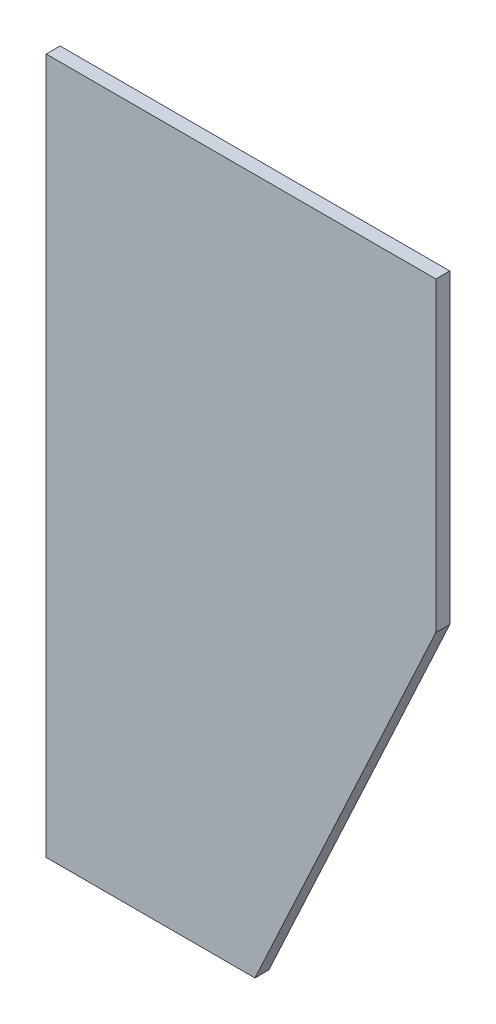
ISO-10303-21;
HEADER;
FILE_DESCRIPTION(('STEP AP214'),'2;1');
FILE_NAME('part.step','',(''),(''),'','','');
FILE_SCHEMA(('AUTOMOTIVE_DESIGN { 1 0 10303 214 1 1 1 1 }'));
ENDSEC;
DATA;
#1=APPLICATION_CONTEXT('core data for automotive mechanical design processes');
#2=APPLICATION_PROTOCOL_DEFINITION('international standard','automotive_design',2000,#1);
#3=PRODUCT_CONTEXT('',#1,'mechanical');
#4=PRODUCT('Part','Part','',(#3));
#5=PRODUCT_RELATED_PRODUCT_CATEGORY('part','',(#4));
#6=PRODUCT_DEFINITION_FORMATION('','',#4);
#7=PRODUCT_DEFINITION_CONTEXT('part definition',#1,'design');
#8=PRODUCT_DEFINITION('design','',#6,#7);
#9=PRODUCT_DEFINITION_SHAPE('','',#8);
#10=(LENGTH_UNIT() NAMED_UNIT(*) SI_UNIT(.MILLI.,.METRE.));
#11=(NAMED_UNIT(*) PLANE_ANGLE_UNIT() SI_UNIT($,.RADIAN.));
#12=(NAMED_UNIT(*) SI_UNIT($,.STERADIAN.) SOLID_ANGLE_UNIT());
#13=UNCERTAINTY_MEASURE_WITH_UNIT(LENGTH_MEASURE(1.E-05),#10,'distance_accuracy_value','');
#14=(GEOMETRIC_REPRESENTATION_CONTEXT(3) GLOBAL_UNCERTAINTY_ASSIGNED_CONTEXT((#13)) GLOBAL_UNIT_ASSIGNED_CONTEXT((#10,
#11,#12)) REPRESENTATION_CONTEXT('',''));
#15=CARTESIAN_POINT('',(0.,0.,0.));
#16=DIRECTION('',(0.,0.,1.));
#17=DIRECTION('',(1.,0.,0.));
#18=AXIS2_PLACEMENT_3D('',#15,#16,#17);
#19=CARTESIAN_POINT('',(150.,0.,10.));
#20=DIRECTION('',(0.,1.,0.));
#21=DIRECTION('',(-1.,0.,0.));
#22=AXIS2_PLACEMENT_3D('',#19,#20,#21);
#23=PLANE('',#22);
#24=DIRECTION('',(1.,0.,0.));
#25=VECTOR('',#24,1.);
#26=CARTESIAN_POINT('',(150.,0.,0.));
#27=LINE('',#26,#25);
#28=CARTESIAN_POINT('',(0.,0.,0.));
#29=VERTEX_POINT('',#28);
#30=CARTESIAN_POINT('',(150.,0.,0.));
#31=VERTEX_POINT('',#30);
#32=EDGE_CURVE('E105',#29,#31,#27,.T.);
#33=ORIENTED_EDGE('',*,*,#32,.T.);
#34=DIRECTION('',(0.,0.,-1.));
#35=VECTOR('',#34,1.);
#36=CARTESIAN_POINT('',(150.,0.,10.));
#37=LINE('',#36,#35);
#38=CARTESIAN_POINT('',(150.,0.,10.));
#39=VERTEX_POINT('',#38);
#40=EDGE_CURVE('E11',#39,#31,#37,.T.);
#41=ORIENTED_EDGE('',*,*,#40,.F.);
#42=DIRECTION('',(1.,0.,0.));
#43=VECTOR('',#42,1.);
#44=CARTESIAN_POINT('',(150.,0.,10.));
#45=LINE('',#44,#43);
#46=CARTESIAN_POINT('',(0.,0.,10.));
#47=VERTEX_POINT('',#46);
#48=EDGE_CURVE('E113',#47,#39,#45,.T.);
#49=ORIENTED_EDGE('',*,*,#48,.F.);
#50=DIRECTION('',(0.,0.,-1.));
#51=VECTOR('',#50,1.);
#52=CARTESIAN_POINT('',(0.,0.,10.));
#53=LINE('',#52,#51);
#54=EDGE_CURVE('E101',#47,#29,#53,.T.);
#55=ORIENTED_EDGE('',*,*,#54,.T.);
#56=EDGE_LOOP('',(#33,#41,#49,#55));
#57=FACE_BOUND('',#56,.T.);
#58=ADVANCED_FACE('F31',(#57),#23,.F.);
#59=CARTESIAN_POINT('',(280.,280.,10.));
#60=DIRECTION('',(-0.907008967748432,0.421111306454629,0.));
#61=DIRECTION('',(-0.421111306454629,-0.907008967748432,0.));
#62=AXIS2_PLACEMENT_3D('',#59,#60,#61);
#63=PLANE('',#62);
#64=DIRECTION('',(0.421111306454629,0.907008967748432,0.));
#65=VECTOR('',#64,1.);
#66=CARTESIAN_POINT('',(280.,280.,0.));
#67=LINE('',#66,#65);
#68=CARTESIAN_POINT('',(280.,280.,0.));
#69=VERTEX_POINT('',#68);
#70=EDGE_CURVE('E108',#31,#69,#67,.T.);
#71=ORIENTED_EDGE('',*,*,#70,.T.);
#72=DIRECTION('',(0.,0.,-1.));
#73=VECTOR('',#72,1.);
#74=CARTESIAN_POINT('',(280.,280.,10.));
#75=LINE('',#74,#73);
#76=CARTESIAN_POINT('',(280.,280.,10.));
#77=VERTEX_POINT('',#76);
#78=EDGE_CURVE('E39',#77,#69,#75,.T.);
#79=ORIENTED_EDGE('',*,*,#78,.F.);
#80=DIRECTION('',(0.421111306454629,0.907008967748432,0.));
#81=VECTOR('',#80,1.);
#82=CARTESIAN_POINT('',(280.,280.,10.));
#83=LINE('',#82,#81);
#84=EDGE_CURVE('E81',#39,#77,#83,.T.);
#85=ORIENTED_EDGE('',*,*,#84,.F.);
#86=ORIENTED_EDGE('',*,*,#40,.T.);
#87=EDGE_LOOP('',(#71,#79,#85,#86));
#88=FACE_BOUND('',#87,.T.);
#89=ADVANCED_FACE('F132',(#88),#63,.F.);
#90=CARTESIAN_POINT('',(280.,500.,10.));
#91=DIRECTION('',(-1.,0.,0.));
#92=DIRECTION('',(0.,0.,1.));
#93=AXIS2_PLACEMENT_3D('',#90,#91,#92);
#94=PLANE('',#93);
#95=DIRECTION('',(0.,1.,0.));
#96=VECTOR('',#95,1.);
#97=CARTESIAN_POINT('',(280.,500.,0.));
#98=LINE('',#97,#96);
#99=CARTESIAN_POINT('',(280.,500.,0.));
#100=VERTEX_POINT('',#99);
#101=EDGE_CURVE('E96',#69,#100,#98,.T.);
#102=ORIENTED_EDGE('',*,*,#101,.T.);
#103=DIRECTION('',(0.,0.,-1.));
#104=VECTOR('',#103,1.);
#105=CARTESIAN_POINT('',(280.,500.,10.));
#106=LINE('',#105,#104);
#107=CARTESIAN_POINT('',(280.,500.,10.));
#108=VERTEX_POINT('',#107);
#109=EDGE_CURVE('E93',#108,#100,#106,.T.);
#110=ORIENTED_EDGE('',*,*,#109,.F.);
#111=DIRECTION('',(0.,1.,0.));
#112=VECTOR('',#111,1.);
#113=CARTESIAN_POINT('',(280.,500.,10.));
#114=LINE('',#113,#112);
#115=EDGE_CURVE('E85',#77,#108,#114,.T.);
#116=ORIENTED_EDGE('',*,*,#115,.F.);
#117=ORIENTED_EDGE('',*,*,#78,.T.);
#118=EDGE_LOOP('',(#102,#110,#116,#117));
#119=FACE_BOUND('',#118,.T.);
#120=ADVANCED_FACE('F94',(#119),#94,.F.);
#121=CARTESIAN_POINT('',(0.,500.,10.));
#122=DIRECTION('',(0.,-1.,0.));
#123=DIRECTION('',(0.,0.,-1.));
#124=AXIS2_PLACEMENT_3D('',#121,#122,#123);
#125=PLANE('',#124);
#126=DIRECTION('',(-1.,0.,0.));
#127=VECTOR('',#126,1.);
#128=CARTESIAN_POINT('',(0.,500.,0.));
#129=LINE('',#128,#127);
#130=CARTESIAN_POINT('',(0.,500.,0.));
#131=VERTEX_POINT('',#130);
#132=EDGE_CURVE('E67',#100,#131,#129,.T.);
#133=ORIENTED_EDGE('',*,*,#132,.T.);
#134=DIRECTION('',(0.,0.,-1.));
#135=VECTOR('',#134,1.);
#136=CARTESIAN_POINT('',(0.,500.,10.));
#137=LINE('',#136,#135);
#138=CARTESIAN_POINT('',(0.,500.,10.));
#139=VERTEX_POINT('',#138);
#140=EDGE_CURVE('E97',#139,#131,#137,.T.);
#141=ORIENTED_EDGE('',*,*,#140,.F.);
#142=DIRECTION('',(-1.,0.,0.));
#143=VECTOR('',#142,1.);
#144=CARTESIAN_POINT('',(0.,500.,10.));
#145=LINE('',#144,#143);
#146=EDGE_CURVE('E89',#108,#139,#145,.T.);
#147=ORIENTED_EDGE('',*,*,#146,.F.);
#148=ORIENTED_EDGE('',*,*,#109,.T.);
#149=EDGE_LOOP('',(#133,#141,#147,#148));
#150=FACE_BOUND('',#149,.T.);
#151=ADVANCED_FACE('F99',(#150),#125,.F.);
#152=CARTESIAN_POINT('',(0.,0.,10.));
#153=DIRECTION('',(1.,0.,0.));
#154=DIRECTION('',(0.,0.,-1.));
#155=AXIS2_PLACEMENT_3D('',#152,#153,#154);
#156=PLANE('',#155);
#157=DIRECTION('',(0.,-1.,0.));
#158=VECTOR('',#157,1.);
#159=CARTESIAN_POINT('',(0.,0.,0.));
#160=LINE('',#159,#158);
#161=EDGE_CURVE('E73',#131,#29,#160,.T.);
#162=ORIENTED_EDGE('',*,*,#161,.T.);
#163=ORIENTED_EDGE('',*,*,#54,.F.);
#164=DIRECTION('',(0.,-1.,0.));
#165=VECTOR('',#164,1.);
#166=CARTESIAN_POINT('',(0.,0.,10.));
#167=LINE('',#166,#165);
#168=EDGE_CURVE('E47',#139,#47,#167,.T.);
#169=ORIENTED_EDGE('',*,*,#168,.F.);
#170=ORIENTED_EDGE('',*,*,#140,.T.);
#171=EDGE_LOOP('',(#162,#163,#169,#170));
#172=FACE_BOUND('',#171,.T.);
#173=ADVANCED_FACE('F121',(#172),#156,.F.);
#174=CARTESIAN_POINT('',(0.,0.,10.));
#175=DIRECTION('',(0.,0.,-1.));
#176=DIRECTION('',(-1.,0.,0.));
#177=AXIS2_PLACEMENT_3D('',#174,#175,#176);
#178=PLANE('',#177);
#179=ORIENTED_EDGE('',*,*,#48,.T.);
#180=ORIENTED_EDGE('',*,*,#84,.T.);
#181=ORIENTED_EDGE('',*,*,#115,.T.);
#182=ORIENTED_EDGE('',*,*,#146,.T.);
#183=ORIENTED_EDGE('',*,*,#168,.T.);
#184=EDGE_LOOP('',(#179,#180,#181,#182,#183));
#185=FACE_BOUND('',#184,.T.);
#186=ADVANCED_FACE('F87',(#185),#178,.F.);
#187=CARTESIAN_POINT('',(0.,0.,0.));
#188=DIRECTION('',(0.,0.,-1.));
#189=DIRECTION('',(-1.,0.,0.));
#190=AXIS2_PLACEMENT_3D('',#187,#188,#189);
#191=PLANE('',#190);
#192=ORIENTED_EDGE('',*,*,#32,.F.);
#193=ORIENTED_EDGE('',*,*,#161,.F.);
#194=ORIENTED_EDGE('',*,*,#132,.F.);
#195=ORIENTED_EDGE('',*,*,#101,.F.);
#196=ORIENTED_EDGE('',*,*,#70,.F.);
#197=EDGE_LOOP('',(#192,#193,#194,#195,#196));
#198=FACE_BOUND('',#197,.T.);
#199=ADVANCED_FACE('F117',(#198),#191,.T.);
#200=CLOSED_SHELL('',(#58,#89,#120,#151,#173,#186,#199));
#201=MANIFOLD_SOLID_BREP('B2',#200);
#202=ADVANCED_BREP_SHAPE_REPRESENTATION('',(#18,#201),#14);
#203=SHAPE_DEFINITION_REPRESENTATION(#9,#202);
ENDSEC;
END-ISO-10303-21;
